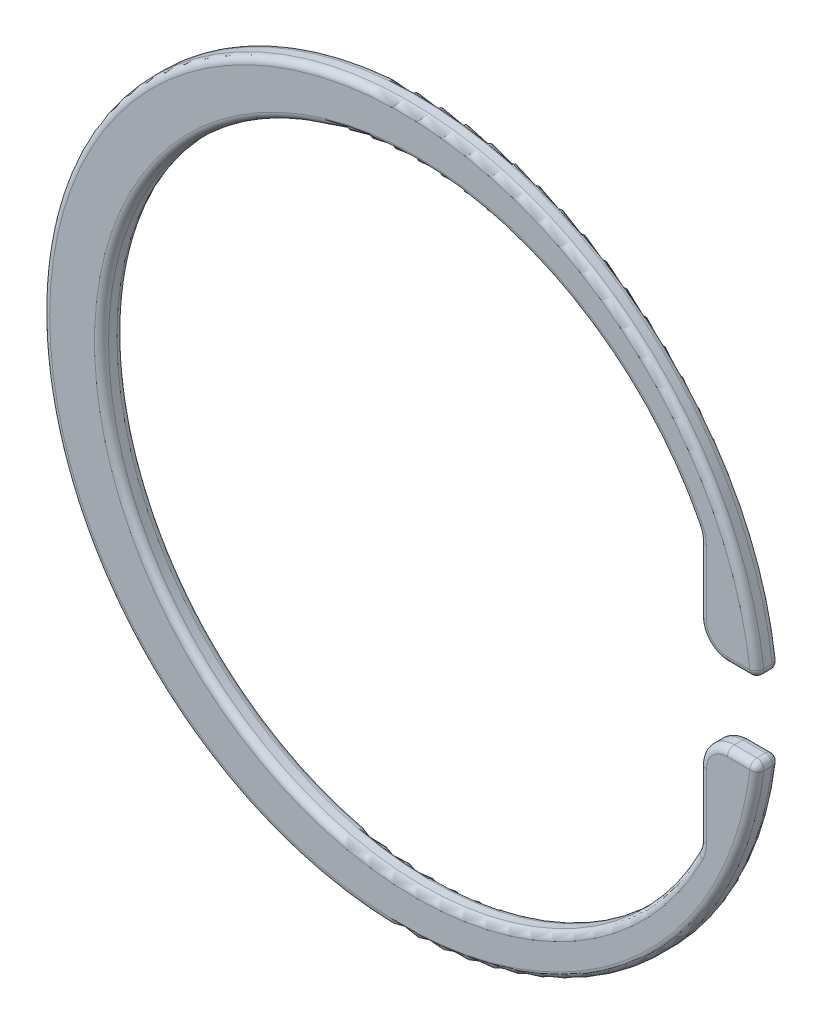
from build123d import *

# Parameters (mm, degrees)
BOSS_EXTRUDE1_DEPTH = 0.4064
FILLET1_R           = 0.508
FILLET2_R           = 0.508
FILLET3_R           = 0.127


with BuildPart() as part:
    # Sketch1 → Boss-Extrude1 (new body)
    with BuildSketch(Plane(origin=(0, 0, 0), x_dir=(-1, 0, 0), z_dir=(0, 0, -1))):
        with BuildLine():
            Line((-5.4102, -2.34369201), (-5.4102, -0.6604))
            Line((-5.4102, -0.6604), (-6.468777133, -0.6604))
            ThreePointArc((-6.468777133, -0.6604), (6.5024, 0), (-6.468777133, 0.6604))
            Line((-6.468777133, 0.6604), (-5.4102, 0.6604))
            Line((-5.4102, 0.6604), (-5.4102, 2.34369201))
            ThreePointArc((-5.4102, 2.34369201), (-5.396348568, 2.461510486), (-5.355549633, 2.572903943))
            ThreePointArc((-5.355549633, 2.572903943), (5.4356, 0), (-5.355549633, -2.572903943))
            ThreePointArc((-5.355549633, -2.572903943), (-5.396348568, -2.461510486), (-5.4102, -2.34369201))
        make_face()
    extrude(amount=-BOSS_EXTRUDE1_DEPTH)

    # Fillet1
    fillet1_edges = [part.edges().sort_by_distance(p)[0] for p in [
        (5.4102, 0.6604, 0.2032),
    ]]
    fillet(fillet1_edges, radius=FILLET1_R)

    # Fillet2
    fillet2_edges = [part.edges().sort_by_distance(p)[0] for p in [
        (5.4102, -0.6604, 0.2032),
    ]]
    fillet(fillet2_edges, radius=FILLET2_R)

    # Fillet3
    fillet3_edges = [part.edges().sort_by_distance(p)[0] for p in [
        (5.4102, -1.756046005, 0),
        (5.396348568, -2.461510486, 0),
        (-6.5024, 0, 0.4064),
        (6.468777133, 0.6604, 0.2032),
        (6.468777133, -0.6604, 0.2032),
        (6.193488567, 0.6604, 0.4064),
        (5.396348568, 2.461510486, 0.4064),
        (5.4102, 1.756046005, 0),
        (5.558989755, 0.809189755, 0),
        (-5.4356, 0, 0.4064),
        (5.4102, 1.756046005, 0.4064),
        (5.558989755, 0.809189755, 0.4064),
        (6.193488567, -0.6604, 0),
        (5.558989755, -0.809189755, 0),
        (6.193488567, -0.6604, 0.4064),
        (5.558989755, -0.809189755, 0.4064),
        (5.396348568, -2.461510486, 0.4064),
        (5.4102, -1.756046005, 0.4064),
        (-5.4356, 0, 0),
        (5.396348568, 2.461510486, 0),
        (6.193488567, 0.6604, 0),
        (-6.5024, 0, 0),
    ]]
    fillet(fillet3_edges, radius=FILLET3_R)


solid = part.part
